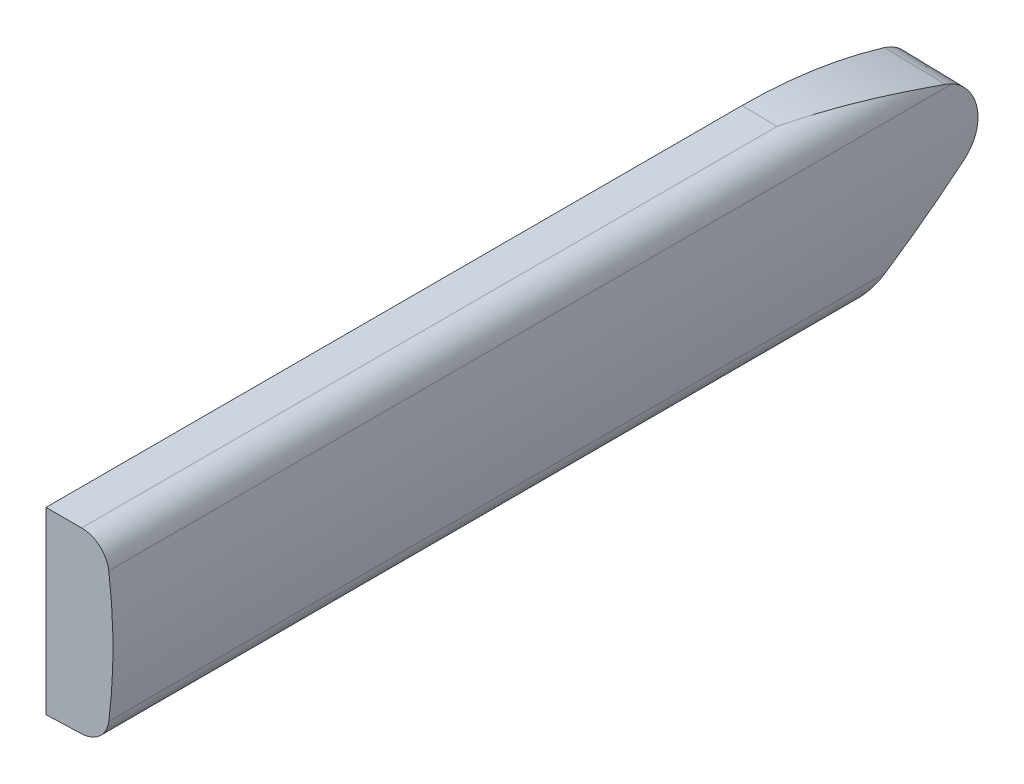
ISO-10303-21;
HEADER;
FILE_DESCRIPTION(('STEP AP214'),'2;1');
FILE_NAME('part.step','',(''),(''),'','','');
FILE_SCHEMA(('AUTOMOTIVE_DESIGN { 1 0 10303 214 1 1 1 1 }'));
ENDSEC;
DATA;
#1=APPLICATION_CONTEXT('core data for automotive mechanical design processes');
#2=APPLICATION_PROTOCOL_DEFINITION('international standard','automotive_design',2000,#1);
#3=PRODUCT_CONTEXT('',#1,'mechanical');
#4=PRODUCT('Part','Part','',(#3));
#5=PRODUCT_RELATED_PRODUCT_CATEGORY('part','',(#4));
#6=PRODUCT_DEFINITION_FORMATION('','',#4);
#7=PRODUCT_DEFINITION_CONTEXT('part definition',#1,'design');
#8=PRODUCT_DEFINITION('design','',#6,#7);
#9=PRODUCT_DEFINITION_SHAPE('','',#8);
#10=(LENGTH_UNIT() NAMED_UNIT(*) SI_UNIT(.MILLI.,.METRE.));
#11=(NAMED_UNIT(*) PLANE_ANGLE_UNIT() SI_UNIT($,.RADIAN.));
#12=(NAMED_UNIT(*) SI_UNIT($,.STERADIAN.) SOLID_ANGLE_UNIT());
#13=UNCERTAINTY_MEASURE_WITH_UNIT(LENGTH_MEASURE(1.E-05),#10,'distance_accuracy_value','');
#14=(GEOMETRIC_REPRESENTATION_CONTEXT(3) GLOBAL_UNCERTAINTY_ASSIGNED_CONTEXT((#13)) GLOBAL_UNIT_ASSIGNED_CONTEXT((#10,
#11,#12)) REPRESENTATION_CONTEXT('',''));
#15=CARTESIAN_POINT('',(0.,0.,0.));
#16=DIRECTION('',(0.,0.,1.));
#17=DIRECTION('',(1.,0.,0.));
#18=AXIS2_PLACEMENT_3D('',#15,#16,#17);
#19=CARTESIAN_POINT('',(0.,32.722620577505,-2.));
#20=DIRECTION('',(0.0174524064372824,0.999847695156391,0.));
#21=DIRECTION('',(-0.999847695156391,0.0174524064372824,0.));
#22=AXIS2_PLACEMENT_3D('',#19,#20,#21);
#23=PLANE('',#22);
#24=DIRECTION('',(0.,0.,1.));
#25=VECTOR('',#24,1.);
#26=CARTESIAN_POINT('',(12.7539243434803,32.5,-2.));
#27=LINE('',#26,#25);
#28=CARTESIAN_POINT('',(12.7539243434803,32.5,62.500000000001));
#29=VERTEX_POINT('',#28);
#30=CARTESIAN_POINT('',(12.7539243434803,32.5,316.000000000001));
#31=VERTEX_POINT('',#30);
#32=EDGE_CURVE('E314',#29,#31,#27,.T.);
#33=ORIENTED_EDGE('',*,*,#32,.F.);
#34=DIRECTION('',(0.999847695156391,-0.0174524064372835,0.));
#35=VECTOR('',#34,1.);
#36=CARTESIAN_POINT('',(0.,32.722620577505,62.500000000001));
#37=LINE('',#36,#35);
#38=CARTESIAN_POINT('',(0.,32.722620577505,62.500000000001));
#39=VERTEX_POINT('',#38);
#40=EDGE_CURVE('E246',#29,#39,#37,.F.);
#41=ORIENTED_EDGE('',*,*,#40,.T.);
#42=DIRECTION('',(0.,0.,1.));
#43=VECTOR('',#42,1.);
#44=CARTESIAN_POINT('',(0.,32.722620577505,-2.));
#45=LINE('',#44,#43);
#46=CARTESIAN_POINT('',(0.,32.722620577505,316.222620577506));
#47=VERTEX_POINT('',#46);
#48=EDGE_CURVE('E338',#39,#47,#45,.T.);
#49=ORIENTED_EDGE('',*,*,#48,.T.);
#50=DIRECTION('',(-0.999695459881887,0.0174497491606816,0.0174497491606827));
#51=VECTOR('',#50,1.);
#52=CARTESIAN_POINT('',(5.55121382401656,32.6257237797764,316.125723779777));
#53=LINE('',#52,#51);
#54=EDGE_CURVE('E317',#31,#47,#53,.T.);
#55=ORIENTED_EDGE('',*,*,#54,.F.);
#56=EDGE_LOOP('',(#33,#41,#49,#55));
#57=FACE_BOUND('',#56,.T.);
#58=ADVANCED_FACE('F34',(#57),#23,.T.);
#59=CARTESIAN_POINT('',(12.5794002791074,22.5015230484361,-2.));
#60=DIRECTION('',(0.,0.,1.));
#61=DIRECTION('',(1.,0.,0.));
#62=AXIS2_PLACEMENT_3D('',#59,#60,#61);
#63=CYLINDRICAL_SURFACE('',#62,10.);
#64=DIRECTION('',(0.,0.,1.));
#65=VECTOR('',#64,1.);
#66=CARTESIAN_POINT('',(22.5,23.7591800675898,-2.));
#67=LINE('',#66,#65);
#68=CARTESIAN_POINT('',(22.5,23.7591800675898,8.35774641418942));
#69=VERTEX_POINT('',#68);
#70=CARTESIAN_POINT('',(22.5,23.7591800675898,315.829881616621));
#71=VERTEX_POINT('',#70);
#72=EDGE_CURVE('E318',#69,#71,#67,.T.);
#73=ORIENTED_EDGE('',*,*,#72,.F.);
#74=CARTESIAN_POINT('',(22.5000253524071,23.7589800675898,8.35734817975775));
#75=CARTESIAN_POINT('',(22.4878789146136,23.8547589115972,8.54804917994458));
#76=CARTESIAN_POINT('',(22.4748592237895,23.9464079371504,8.74076411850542));
#77=CARTESIAN_POINT('',(22.4477677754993,24.1211388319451,9.1295374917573));
#78=CARTESIAN_POINT('',(22.4336980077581,24.2042362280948,9.32558908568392));
#79=CARTESIAN_POINT('',(22.405151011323,24.361911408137,9.72105857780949));
#80=CARTESIAN_POINT('',(22.3906737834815,24.4364892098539,9.92047646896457));
#81=CARTESIAN_POINT('',(22.3618844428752,24.5771254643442,10.3227220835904));
#82=CARTESIAN_POINT('',(22.3475726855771,24.6431678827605,10.5255554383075));
#83=CARTESIAN_POINT('',(22.3336584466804,24.7048041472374,10.7297478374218));
#84=B_SPLINE_CURVE_WITH_KNOTS('',3,(#74,#75,#76,#77,#78,#79,#80,#81,#82,#83),.UNSPECIFIED.,.F.,
.F.,(4,2,2,2,4),(0.,0.641185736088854,1.28118595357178,1.92118483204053,2.56236904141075),.UNSPECIFIED.);
#85=CARTESIAN_POINT('',(22.3342442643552,24.7022090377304,10.721160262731));
#86=VERTEX_POINT('',#85);
#87=EDGE_CURVE('E344',#69,#86,#84,.T.);
#88=ORIENTED_EDGE('',*,*,#87,.T.);
#89=CARTESIAN_POINT('',(18.2962657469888,14.2968018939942,-16.0791997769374));
#90=CARTESIAN_POINT('',(18.3765804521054,14.3527674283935,-15.961003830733));
#91=CARTESIAN_POINT('',(18.4549792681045,14.4091414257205,-15.8417174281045));
#92=CARTESIAN_POINT('',(18.6081351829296,14.5225851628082,-15.6011751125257));
#93=CARTESIAN_POINT('',(18.682892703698,14.579654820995,-15.4799194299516));
#94=CARTESIAN_POINT('',(18.9019175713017,14.7516682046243,-15.113637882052));
#95=CARTESIAN_POINT('',(19.0410444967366,14.8674917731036,-14.8659383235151));
#96=CARTESIAN_POINT('',(19.3065333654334,15.100390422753,-14.365450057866));
#97=CARTESIAN_POINT('',(19.4329298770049,15.2174611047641,-14.1126774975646));
#98=CARTESIAN_POINT('',(19.674583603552,15.4526366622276,-13.6022843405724));
#99=CARTESIAN_POINT('',(19.789838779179,15.5707417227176,-13.3446628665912));
#100=CARTESIAN_POINT('',(20.0089886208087,15.8062404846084,-12.8281886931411));
#101=CARTESIAN_POINT('',(20.1129926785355,15.9236280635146,-12.5693794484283));
#102=CARTESIAN_POINT('',(20.3118884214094,16.1586291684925,-12.0483738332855));
#103=CARTESIAN_POINT('',(20.4067793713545,16.2762427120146,-11.7861771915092));
#104=CARTESIAN_POINT('',(20.6790440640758,16.6291912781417,-10.9948001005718));
#105=CARTESIAN_POINT('',(20.8438423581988,16.8644509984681,-10.461233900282));
#106=CARTESIAN_POINT('',(21.1603189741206,17.357377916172,-9.32956205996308));
#107=CARTESIAN_POINT('',(21.3088630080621,17.614837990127,-8.73050300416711));
#108=CARTESIAN_POINT('',(21.5759852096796,18.1260682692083,-7.52408916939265));
#109=CARTESIAN_POINT('',(21.6945564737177,18.3798376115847,-6.91673251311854));
#110=CARTESIAN_POINT('',(21.905647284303,18.8827532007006,-5.69532042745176));
#111=CARTESIAN_POINT('',(21.9981544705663,19.1318972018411,-5.08126196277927));
#112=CARTESIAN_POINT('',(22.1601776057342,19.6247257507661,-3.84803180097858));
#113=CARTESIAN_POINT('',(22.2296952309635,19.868410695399,-3.22886048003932));
#114=CARTESIAN_POINT('',(22.3489190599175,20.3522886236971,-1.97997822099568));
#115=CARTESIAN_POINT('',(22.3984167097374,20.592420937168,-1.35022412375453));
#116=CARTESIAN_POINT('',(22.4787808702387,21.0662539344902,-0.0871324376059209));
#117=CARTESIAN_POINT('',(22.5096472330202,21.2999545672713,0.546205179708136));
#118=CARTESIAN_POINT('',(22.5545956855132,21.7605765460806,1.81569204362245));
#119=CARTESIAN_POINT('',(22.5686830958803,21.9875000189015,2.45184033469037));
#120=CARTESIAN_POINT('',(22.5816738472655,22.4344494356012,3.72671532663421));
#121=CARTESIAN_POINT('',(22.580576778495,22.6544751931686,4.36544209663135));
#122=CARTESIAN_POINT('',(22.5631621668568,23.1255476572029,5.75761692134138));
#123=CARTESIAN_POINT('',(22.5442021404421,23.3752458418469,6.51148805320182));
#124=CARTESIAN_POINT('',(22.489108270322,23.8647307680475,8.02184226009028));
#125=CARTESIAN_POINT('',(22.4529735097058,24.1045169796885,8.77832547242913));
#126=CARTESIAN_POINT('',(22.3651821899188,24.5740910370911,10.2936335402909));
#127=CARTESIAN_POINT('',(22.3135228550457,24.8038770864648,11.0524587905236));
#128=CARTESIAN_POINT('',(22.1961288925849,25.2533314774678,12.5720238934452));
#129=CARTESIAN_POINT('',(22.1303937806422,25.4729994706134,13.3327638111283));
#130=CARTESIAN_POINT('',(21.9138981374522,26.1171438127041,15.6188847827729));
#131=CARTESIAN_POINT('',(21.7439311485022,26.5263374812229,17.1468016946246));
#132=CARTESIAN_POINT('',(21.3615580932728,27.3037333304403,20.207475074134));
#133=CARTESIAN_POINT('',(21.1491554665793,27.6719388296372,21.7402311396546));
#134=CARTESIAN_POINT('',(20.6895031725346,28.3666106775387,24.8059412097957));
#135=CARTESIAN_POINT('',(20.4423393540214,28.6931761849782,26.3388857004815));
#136=CARTESIAN_POINT('',(19.9186759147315,29.3057410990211,29.4078641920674));
#137=CARTESIAN_POINT('',(19.6421755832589,29.5917395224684,30.9438982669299));
#138=CARTESIAN_POINT('',(19.0650796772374,30.1231852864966,34.0175324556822));
#139=CARTESIAN_POINT('',(18.7644974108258,30.3686547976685,35.5551312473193));
#140=CARTESIAN_POINT('',(18.1435815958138,30.8193984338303,38.6321442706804));
#141=CARTESIAN_POINT('',(17.8232487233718,31.0246739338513,40.1715584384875));
#142=CARTESIAN_POINT('',(17.127676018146,31.4173034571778,43.4355795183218));
#143=CARTESIAN_POINT('',(16.75044448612,31.5995992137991,45.1603738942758));
#144=CARTESIAN_POINT('',(15.981405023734,31.9142256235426,48.6111329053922));
#145=CARTESIAN_POINT('',(15.5895972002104,32.0465566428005,50.3370975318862));
#146=CARTESIAN_POINT('',(14.4000268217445,32.3686380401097,55.5136872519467));
#147=CARTESIAN_POINT('',(13.5874433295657,32.4838468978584,58.9660911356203));
#148=CARTESIAN_POINT('',(12.7668993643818,32.4997672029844,62.4449905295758));
#149=CARTESIAN_POINT('',(12.7604118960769,32.4998867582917,62.4724952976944));
#150=CARTESIAN_POINT('',(12.7539243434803,32.5,62.500000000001));
#151=B_SPLINE_CURVE_WITH_KNOTS('',3,(#89,#90,#91,#92,#93,#94,#95,#96,#97,#98,#99,#100,#101,#102,
#103,#104,#105,#106,#107,#108,#109,#110,#111,#112,#113,#114,#115,#116,#117,#118,#119,#120,#121,
#122,#123,#124,#125,#126,#127,#128,#129,#130,#131,#132,#133,#134,#135,#136,#137,#138,#139,#140,
#141,#142,#143,#144,#145,#146,#147,#148,#149,#150),.UNSPECIFIED.,.F.,.F.,(4,2,2,2,2,2,2,2,2,2,2,
2,2,2,2,2,2,2,2,2,2,2,2,2,2,2,2,2,2,2,4),(0.,0.460368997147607,0.92068452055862,1.8406975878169,
2.75814098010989,3.6757519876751,4.58343814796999,5.49119747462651,7.3081294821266,
9.3135371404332,11.3194062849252,13.3262250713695,15.3328974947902,17.3599665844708,
19.3870517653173,21.4134939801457,23.4399908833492,25.8228319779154,28.2058002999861,
30.5891949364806,32.9726716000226,37.7439170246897,42.5147758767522,47.2740526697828,
52.0334447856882,56.7902246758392,61.5468418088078,66.8708275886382,72.1947743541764,
82.8331483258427,82.9179275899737),.UNSPECIFIED.);
#152=EDGE_CURVE('E264',#86,#29,#151,.T.);
#153=ORIENTED_EDGE('',*,*,#152,.T.);
#154=ORIENTED_EDGE('',*,*,#32,.T.);
#155=CARTESIAN_POINT('',(12.5794002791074,22.5015230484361,316.003046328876));
#156=DIRECTION('',(-0.0174524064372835,0.,-0.999847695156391));
#157=DIRECTION('',(-0.999847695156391,0.,0.0174524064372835));
#158=AXIS2_PLACEMENT_3D('',#155,#156,#157);
#159=ELLIPSE('',#158,10.0015232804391,10.);
#160=EDGE_CURVE('E261',#31,#71,#159,.T.);
#161=ORIENTED_EDGE('',*,*,#160,.T.);
#162=EDGE_LOOP('',(#73,#88,#153,#154,#161));
#163=FACE_BOUND('',#162,.T.);
#164=ADVANCED_FACE('F279',(#163),#63,.T.);
#165=CARTESIAN_POINT('',(-164.916212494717,0.,-2.));
#166=DIRECTION('',(0.,0.,1.));
#167=DIRECTION('',(1.,0.,0.));
#168=AXIS2_PLACEMENT_3D('',#165,#166,#167);
#169=CYLINDRICAL_SURFACE('',#168,188.916212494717);
#170=DIRECTION('',(0.,0.,1.));
#171=VECTOR('',#170,1.);
#172=CARTESIAN_POINT('',(22.5,-23.7591800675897,-2.));
#173=LINE('',#172,#171);
#174=CARTESIAN_POINT('',(22.5,-23.7591800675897,32.7573007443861));
#175=VERTEX_POINT('',#174);
#176=CARTESIAN_POINT('',(22.5,-23.7591800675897,315.829881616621));
#177=VERTEX_POINT('',#176);
#178=EDGE_CURVE('E322',#175,#177,#173,.T.);
#179=ORIENTED_EDGE('',*,*,#178,.F.);
#180=CARTESIAN_POINT('',(-164.916212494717,0.,-0.647123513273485));
#181=DIRECTION('',(-0.0174524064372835,0.76592777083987,0.642689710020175));
#182=DIRECTION('',(0.0146405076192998,-0.642522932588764,0.766126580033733));
#183=AXIS2_PLACEMENT_3D('',#180,#181,#182);
#184=ELLIPSE('',#183,293.946222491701,188.916212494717);
#185=CARTESIAN_POINT('',(23.9981310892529,-0.840316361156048,5.48434472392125));
#186=VERTEX_POINT('',#185);
#187=EDGE_CURVE('E349',#175,#186,#184,.T.);
#188=ORIENTED_EDGE('',*,*,#187,.T.);
#189=CARTESIAN_POINT('',(23.9964299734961,-1.16140390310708,5.88062454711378));
#190=CARTESIAN_POINT('',(23.9980069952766,-0.905037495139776,5.55276781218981));
#191=CARTESIAN_POINT('',(23.9991459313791,-0.634785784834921,5.23577643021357));
#192=CARTESIAN_POINT('',(24.0001993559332,-0.0685940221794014,4.62565360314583));
#193=CARTESIAN_POINT('',(24.0001138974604,0.227344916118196,4.33252112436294));
#194=CARTESIAN_POINT('',(23.9983710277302,0.842648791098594,3.77240103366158));
#195=CARTESIAN_POINT('',(23.9967146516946,1.16199817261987,3.5053963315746));
#196=CARTESIAN_POINT('',(23.9915017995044,1.82200497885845,2.99919867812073));
#197=CARTESIAN_POINT('',(23.9879453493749,2.16266211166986,2.76000534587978));
#198=CARTESIAN_POINT('',(23.9786287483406,2.86303805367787,2.31100926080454));
#199=CARTESIAN_POINT('',(23.9728674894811,3.22276636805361,2.1012213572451));
#200=CARTESIAN_POINT('',(23.9588799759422,3.9585554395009,1.71266211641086));
#201=CARTESIAN_POINT('',(23.9506537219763,4.33461619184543,1.53389077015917));
#202=CARTESIAN_POINT('',(23.9315277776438,5.10028805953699,1.20866327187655));
#203=CARTESIAN_POINT('',(23.920628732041,5.48989588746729,1.06219934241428));
#204=CARTESIAN_POINT('',(23.8960054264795,6.27995959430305,0.802556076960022));
#205=CARTESIAN_POINT('',(23.8822811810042,6.68041541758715,0.68937657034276));
#206=CARTESIAN_POINT('',(23.8519318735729,7.4891014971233,0.49713252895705));
#207=CARTESIAN_POINT('',(23.8353083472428,7.89732753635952,0.418050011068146));
#208=CARTESIAN_POINT('',(23.7991446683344,8.71885080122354,0.294444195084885));
#209=CARTESIAN_POINT('',(23.7796045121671,9.13214803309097,0.249920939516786));
#210=CARTESIAN_POINT('',(23.7376682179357,9.96096602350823,0.195708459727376));
#211=CARTESIAN_POINT('',(23.7152714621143,10.3764872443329,0.186026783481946));
#212=CARTESIAN_POINT('',(23.6677677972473,11.2067216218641,0.201548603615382));
#213=CARTESIAN_POINT('',(23.6426608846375,11.6214347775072,0.226752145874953));
#214=CARTESIAN_POINT('',(23.5899094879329,12.4478536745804,0.311902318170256));
#215=CARTESIAN_POINT('',(23.5622606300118,12.8595528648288,0.371909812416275));
#216=CARTESIAN_POINT('',(23.5047565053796,13.6763077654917,0.526254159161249));
#217=CARTESIAN_POINT('',(23.4749012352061,14.0813634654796,0.620591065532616));
#218=CARTESIAN_POINT('',(23.4133513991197,14.8819309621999,0.84288081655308));
#219=CARTESIAN_POINT('',(23.3816571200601,15.2774442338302,0.970828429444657));
#220=CARTESIAN_POINT('',(23.3168489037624,16.0562335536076,1.25942436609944));
#221=CARTESIAN_POINT('',(23.2837349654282,16.4395095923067,1.42007271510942));
#222=CARTESIAN_POINT('',(23.2164106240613,17.1928810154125,1.77374027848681));
#223=CARTESIAN_POINT('',(23.1821958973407,17.5629080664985,1.96690424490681));
#224=CARTESIAN_POINT('',(23.1133425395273,18.2853345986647,2.38372301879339));
#225=CARTESIAN_POINT('',(23.0787039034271,18.6377338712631,2.60737818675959));
#226=CARTESIAN_POINT('',(23.0095596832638,19.3224725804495,3.083642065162));
#227=CARTESIAN_POINT('',(22.9750541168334,19.6548094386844,3.33625448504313));
#228=CARTESIAN_POINT('',(22.9067628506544,20.2970336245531,3.86864998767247));
#229=CARTESIAN_POINT('',(22.8729771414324,20.6069212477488,4.14843271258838));
#230=CARTESIAN_POINT('',(22.8076543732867,21.1936270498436,4.72494232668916));
#231=CARTESIAN_POINT('',(22.776080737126,21.4711328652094,5.02096571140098));
#232=CARTESIAN_POINT('',(22.7147074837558,22.0010076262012,5.63487870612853));
#233=CARTESIAN_POINT('',(22.6849078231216,22.2533771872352,5.95276778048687));
#234=CARTESIAN_POINT('',(22.6275892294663,22.7313851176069,6.6085053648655));
#235=CARTESIAN_POINT('',(22.6000715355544,22.9570089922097,6.94636455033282));
#236=CARTESIAN_POINT('',(22.5478160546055,23.3798721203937,7.63965184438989));
#237=CARTESIAN_POINT('',(22.5230785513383,23.5771084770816,7.99508174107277));
#238=CARTESIAN_POINT('',(22.4999746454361,23.7593800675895,8.35814467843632));
#239=B_SPLINE_CURVE_WITH_KNOTS('',3,(#189,#190,#191,#192,#193,#194,#195,#196,#197,#198,#199,
#200,#201,#202,#203,#204,#205,#206,#207,#208,#209,#210,#211,#212,#213,#214,#215,#216,#217,#218,
#219,#220,#221,#222,#223,#224,#225,#226,#227,#228,#229,#230,#231,#232,#233,#234,#235,#236,#237,
#238),.UNSPECIFIED.,.F.,.F.,(4,2,2,2,2,2,2,2,2,2,2,2,2,2,2,2,2,2,2,2,2,2,2,2,4),(0.,
1.24819785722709,2.49634160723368,3.74366341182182,4.99096813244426,6.23890047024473,
7.48683244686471,8.73446367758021,9.9820885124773,11.2290545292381,12.4760220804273,
13.7232597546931,14.9704990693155,16.2199261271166,17.4693551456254,18.7185897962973,
19.9678254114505,21.2227769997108,22.4777434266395,23.7328707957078,24.9879816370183,
26.2075763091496,27.4271411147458,28.6473638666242,29.8677110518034),.UNSPECIFIED.);
#240=EDGE_CURVE('E272',#186,#69,#239,.T.);
#241=ORIENTED_EDGE('',*,*,#240,.T.);
#242=ORIENTED_EDGE('',*,*,#72,.T.);
#243=CARTESIAN_POINT('',(-164.916212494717,0.,319.101243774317));
#244=DIRECTION('',(-0.0174524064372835,0.,-0.999847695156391));
#245=DIRECTION('',(-0.999847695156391,0.,0.0174524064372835));
#246=AXIS2_PLACEMENT_3D('',#243,#244,#245);
#247=ELLIPSE('',#246,188.944989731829,188.916212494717);
#248=EDGE_CURVE('E259',#71,#177,#247,.T.);
#249=ORIENTED_EDGE('',*,*,#248,.T.);
#250=EDGE_LOOP('',(#179,#188,#241,#242,#249));
#251=FACE_BOUND('',#250,.T.);
#252=ADVANCED_FACE('F310',(#251),#169,.T.);
#253=CARTESIAN_POINT('',(12.5794002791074,-22.5015230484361,-2.));
#254=DIRECTION('',(0.,0.,1.));
#255=DIRECTION('',(1.,0.,0.));
#256=AXIS2_PLACEMENT_3D('',#253,#254,#255);
#257=CYLINDRICAL_SURFACE('',#256,10.);
#258=DIRECTION('',(0.,0.,1.));
#259=VECTOR('',#258,1.);
#260=CARTESIAN_POINT('',(12.7539243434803,-32.5,-2.));
#261=LINE('',#260,#259);
#262=CARTESIAN_POINT('',(12.7539243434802,-32.5,44.7293982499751));
#263=VERTEX_POINT('',#262);
#264=CARTESIAN_POINT('',(12.75392434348,-32.5,316.000000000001));
#265=VERTEX_POINT('',#264);
#266=EDGE_CURVE('E334',#263,#265,#261,.T.);
#267=ORIENTED_EDGE('',*,*,#266,.F.);
#268=CARTESIAN_POINT('',(12.7539243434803,-32.5,44.7293982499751));
#269=CARTESIAN_POINT('',(12.759366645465,-32.4999050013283,44.7255490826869));
#270=CARTESIAN_POINT('',(12.7648089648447,-32.4998055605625,44.7216999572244));
#271=CARTESIAN_POINT('',(13.1078588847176,-32.4932574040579,44.4790787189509));
#272=CARTESIAN_POINT('',(13.4455183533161,-32.4697165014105,44.2404932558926));
#273=CARTESIAN_POINT('',(14.1193866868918,-32.3880686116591,43.7666693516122));
#274=CARTESIAN_POINT('',(14.4555939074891,-32.3299294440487,43.5314342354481));
#275=CARTESIAN_POINT('',(15.1247203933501,-32.1782497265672,43.0676631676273));
#276=CARTESIAN_POINT('',(15.4576394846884,-32.0847073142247,42.8391275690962));
#277=CARTESIAN_POINT('',(16.1179467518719,-31.86101181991,42.3927230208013));
#278=CARTESIAN_POINT('',(16.4453405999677,-31.7308990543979,42.1748426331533));
#279=CARTESIAN_POINT('',(16.9002057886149,-31.5210347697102,41.879179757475));
#280=CARTESIAN_POINT('',(17.0310048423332,-31.4572274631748,41.7949985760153));
#281=CARTESIAN_POINT('',(17.290916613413,-31.3232542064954,41.6296641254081));
#282=CARTESIAN_POINT('',(17.4200316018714,-31.2530981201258,41.5485064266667));
#283=CARTESIAN_POINT('',(17.5483202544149,-31.1796469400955,41.4689785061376));
#284=B_SPLINE_CURVE_WITH_KNOTS('',3,(#268,#269,#270,#271,#272,#273,#274,#275,#276,#277,#278,
#279,#280,#281,#282,#283),.UNSPECIFIED.,.F.,.F.,(4,2,2,2,2,2,2,4),(0.,0.0200000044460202,
1.2606726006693,2.50250097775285,3.74439469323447,4.98492463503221,5.48917146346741,
5.99264789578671),.UNSPECIFIED.);
#285=CARTESIAN_POINT('',(17.3903144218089,-31.2682273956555,41.5674800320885));
#286=VERTEX_POINT('',#285);
#287=EDGE_CURVE('E325',#263,#286,#284,.T.);
#288=ORIENTED_EDGE('',*,*,#287,.T.);
#289=CARTESIAN_POINT('',(12.5794002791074,-22.5015230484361,30.9890870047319));
#290=DIRECTION('',(-0.0174524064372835,0.76592777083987,0.642689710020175));
#291=DIRECTION('',(0.0146405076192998,-0.642522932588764,0.766126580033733));
#292=AXIS2_PLACEMENT_3D('',#289,#290,#291);
#293=ELLIPSE('',#292,15.5596080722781,10.);
#294=EDGE_CURVE('E347',#286,#175,#293,.T.);
#295=ORIENTED_EDGE('',*,*,#294,.T.);
#296=ORIENTED_EDGE('',*,*,#178,.T.);
#297=CARTESIAN_POINT('',(12.5794002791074,-22.5015230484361,316.003046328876));
#298=DIRECTION('',(-0.0174524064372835,0.,-0.999847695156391));
#299=DIRECTION('',(-0.999847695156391,0.,0.0174524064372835));
#300=AXIS2_PLACEMENT_3D('',#297,#298,#299);
#301=ELLIPSE('',#300,10.0015232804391,10.);
#302=EDGE_CURVE('E249',#177,#265,#301,.T.);
#303=ORIENTED_EDGE('',*,*,#302,.T.);
#304=EDGE_LOOP('',(#267,#288,#295,#296,#303));
#305=FACE_BOUND('',#304,.T.);
#306=ADVANCED_FACE('F360',(#305),#257,.T.);
#307=CARTESIAN_POINT('',(0.,32.722620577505,-2.));
#308=DIRECTION('',(-1.,0.,0.));
#309=DIRECTION('',(0.,0.,1.));
#310=AXIS2_PLACEMENT_3D('',#307,#308,#309);
#311=PLANE('',#310);
#312=DIRECTION('',(0.,0.642787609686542,-0.766044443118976));
#313=VECTOR('',#312,1.);
#314=CARTESIAN_POINT('',(0.,17.9238357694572,-14.4176548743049));
#315=LINE('',#314,#313);
#316=CARTESIAN_POINT('',(0.,0.371118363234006,6.5008591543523));
#317=VERTEX_POINT('',#316);
#318=CARTESIAN_POINT('',(0.,-29.9684372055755,42.6581335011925));
#319=VERTEX_POINT('',#318);
#320=EDGE_CURVE('E225',#317,#319,#315,.F.);
#321=ORIENTED_EDGE('',*,*,#320,.F.);
#322=CARTESIAN_POINT('',(0.,10.5,15.000000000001));
#323=DIRECTION('',(-1.,0.,0.));
#324=DIRECTION('',(0.,0.,1.));
#325=AXIS2_PLACEMENT_3D('',#322,#323,#324);
#326=CIRCLE('',#325,13.2223159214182);
#327=CARTESIAN_POINT('',(0.,23.1602133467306,11.185732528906));
#328=VERTEX_POINT('',#327);
#329=EDGE_CURVE('E221',#328,#317,#326,.T.);
#330=ORIENTED_EDGE('',*,*,#329,.F.);
#331=CARTESIAN_POINT('',(0.,-147.160714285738,62.500000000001));
#332=DIRECTION('',(-1.,0.,0.));
#333=DIRECTION('',(0.,0.,1.));
#334=AXIS2_PLACEMENT_3D('',#331,#332,#333);
#335=CIRCLE('',#334,177.883030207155);
#336=CARTESIAN_POINT('',(0.,30.7223159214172,62.500000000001));
#337=VERTEX_POINT('',#336);
#338=EDGE_CURVE('E48',#337,#328,#335,.T.);
#339=ORIENTED_EDGE('',*,*,#338,.F.);
#340=DIRECTION('',(0.,0.,1.));
#341=VECTOR('',#340,1.);
#342=CARTESIAN_POINT('',(0.,30.7223159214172,-2.));
#343=LINE('',#342,#341);
#344=CARTESIAN_POINT('',(0.,30.7223159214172,314.222315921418));
#345=VERTEX_POINT('',#344);
#346=EDGE_CURVE('E167',#337,#345,#343,.T.);
#347=ORIENTED_EDGE('',*,*,#346,.T.);
#348=DIRECTION('',(0.,1.,0.));
#349=VECTOR('',#348,1.);
#350=CARTESIAN_POINT('',(0.,-32.722620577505,314.222315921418));
#351=LINE('',#350,#349);
#352=CARTESIAN_POINT('',(0.,-30.7223159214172,314.222315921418));
#353=VERTEX_POINT('',#352);
#354=EDGE_CURVE('E188',#345,#353,#351,.F.);
#355=ORIENTED_EDGE('',*,*,#354,.T.);
#356=DIRECTION('',(0.,0.,1.));
#357=VECTOR('',#356,1.);
#358=CARTESIAN_POINT('',(0.,-30.7223159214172,-2.));
#359=LINE('',#358,#357);
#360=CARTESIAN_POINT('',(0.,-30.7223159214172,44.7293982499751));
#361=VERTEX_POINT('',#360);
#362=EDGE_CURVE('E218',#361,#353,#359,.T.);
#363=ORIENTED_EDGE('',*,*,#362,.F.);
#364=CARTESIAN_POINT('',(0.,-27.5,44.7293982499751));
#365=DIRECTION('',(-1.,0.,0.));
#366=DIRECTION('',(0.,0.,1.));
#367=AXIS2_PLACEMENT_3D('',#364,#365,#366);
#368=CIRCLE('',#367,3.22231592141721);
#369=EDGE_CURVE('E222',#319,#361,#368,.T.);
#370=ORIENTED_EDGE('',*,*,#369,.F.);
#371=EDGE_LOOP('',(#321,#330,#339,#347,#355,#363,#370));
#372=FACE_BOUND('',#371,.T.);
#373=DIRECTION('',(0.,-0.642787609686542,0.766044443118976));
#374=VECTOR('',#373,1.);
#375=CARTESIAN_POINT('',(0.,-1.16120390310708,5.21508810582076));
#376=LINE('',#375,#374);
#377=CARTESIAN_POINT('',(0.,-1.16120390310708,5.21508810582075));
#378=VERTEX_POINT('',#377);
#379=CARTESIAN_POINT('',(0.,-31.5007594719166,41.3723624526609));
#380=VERTEX_POINT('',#379);
#381=EDGE_CURVE('E241',#378,#380,#376,.T.);
#382=ORIENTED_EDGE('',*,*,#381,.T.);
#383=CARTESIAN_POINT('',(0.,-27.5,44.7293982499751));
#384=DIRECTION('',(-1.,0.,0.));
#385=DIRECTION('',(0.,0.,1.));
#386=AXIS2_PLACEMENT_3D('',#383,#384,#385);
#387=CIRCLE('',#386,5.22262057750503);
#388=CARTESIAN_POINT('',(0.,-32.722620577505,44.7293982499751));
#389=VERTEX_POINT('',#388);
#390=EDGE_CURVE('E214',#380,#389,#387,.T.);
#391=ORIENTED_EDGE('',*,*,#390,.T.);
#392=DIRECTION('',(0.,0.,1.));
#393=VECTOR('',#392,1.);
#394=CARTESIAN_POINT('',(0.,-32.722620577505,-2.));
#395=LINE('',#394,#393);
#396=CARTESIAN_POINT('',(0.,-32.722620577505,316.222620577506));
#397=VERTEX_POINT('',#396);
#398=EDGE_CURVE('E56',#389,#397,#395,.T.);
#399=ORIENTED_EDGE('',*,*,#398,.T.);
#400=DIRECTION('',(0.,-1.,0.));
#401=VECTOR('',#400,1.);
#402=CARTESIAN_POINT('',(0.,32.722620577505,316.222620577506));
#403=LINE('',#402,#401);
#404=EDGE_CURVE('E41',#47,#397,#403,.T.);
#405=ORIENTED_EDGE('',*,*,#404,.F.);
#406=ORIENTED_EDGE('',*,*,#48,.F.);
#407=CARTESIAN_POINT('',(0.,-147.160714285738,62.500000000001));
#408=DIRECTION('',(-1.,0.,0.));
#409=DIRECTION('',(0.,0.,1.));
#410=AXIS2_PLACEMENT_3D('',#407,#408,#409);
#411=CIRCLE('',#410,179.883334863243);
#412=CARTESIAN_POINT('',(0.,25.0754817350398,10.608700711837));
#413=VERTEX_POINT('',#412);
#414=EDGE_CURVE('E235',#39,#413,#411,.T.);
#415=ORIENTED_EDGE('',*,*,#414,.T.);
#416=CARTESIAN_POINT('',(0.,10.5,15.000000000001));
#417=DIRECTION('',(-1.,0.,0.));
#418=DIRECTION('',(0.,0.,1.));
#419=AXIS2_PLACEMENT_3D('',#416,#417,#418);
#420=CIRCLE('',#419,15.222620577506);
#421=EDGE_CURVE('E238',#413,#378,#420,.T.);
#422=ORIENTED_EDGE('',*,*,#421,.T.);
#423=EDGE_LOOP('',(#382,#391,#399,#405,#406,#415,#422));
#424=FACE_BOUND('',#423,.T.);
#425=ADVANCED_FACE('F301',(#372,#424),#311,.T.);
#426=CARTESIAN_POINT('',(0.,-32.722620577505,-2.));
#427=DIRECTION('',(0.0174524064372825,-0.999847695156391,0.));
#428=DIRECTION('',(0.999847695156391,0.0174524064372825,0.));
#429=AXIS2_PLACEMENT_3D('',#426,#427,#428);
#430=PLANE('',#429);
#431=DIRECTION('',(0.999847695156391,0.0174524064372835,0.));
#432=VECTOR('',#431,1.);
#433=CARTESIAN_POINT('',(0.,-32.722620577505,44.7293982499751));
#434=LINE('',#433,#432);
#435=EDGE_CURVE('E244',#263,#389,#434,.F.);
#436=ORIENTED_EDGE('',*,*,#435,.F.);
#437=ORIENTED_EDGE('',*,*,#266,.T.);
#438=DIRECTION('',(-0.999695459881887,-0.0174497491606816,0.0174497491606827));
#439=VECTOR('',#438,1.);
#440=CARTESIAN_POINT('',(0.,-32.722620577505,316.222620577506));
#441=LINE('',#440,#439);
#442=EDGE_CURVE('E12',#265,#397,#441,.T.);
#443=ORIENTED_EDGE('',*,*,#442,.T.);
#444=ORIENTED_EDGE('',*,*,#398,.F.);
#445=EDGE_LOOP('',(#436,#437,#443,#444));
#446=FACE_BOUND('',#445,.T.);
#447=ADVANCED_FACE('F292',(#446),#430,.T.);
#448=CARTESIAN_POINT('',(0.,-32.722620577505,316.222620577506));
#449=DIRECTION('',(-0.0174524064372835,0.,-0.999847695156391));
#450=DIRECTION('',(-0.999847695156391,0.,0.0174524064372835));
#451=AXIS2_PLACEMENT_3D('',#448,#449,#450);
#452=PLANE('',#451);
#453=ORIENTED_EDGE('',*,*,#160,.F.);
#454=ORIENTED_EDGE('',*,*,#54,.T.);
#455=ORIENTED_EDGE('',*,*,#404,.T.);
#456=ORIENTED_EDGE('',*,*,#442,.F.);
#457=ORIENTED_EDGE('',*,*,#302,.F.);
#458=ORIENTED_EDGE('',*,*,#248,.F.);
#459=EDGE_LOOP('',(#453,#454,#455,#456,#457,#458));
#460=FACE_BOUND('',#459,.T.);
#461=ADVANCED_FACE('F289',(#460),#452,.F.);
#462=CARTESIAN_POINT('',(0.,-27.5,44.7293982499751));
#463=DIRECTION('',(-1.,0.,0.));
#464=DIRECTION('',(0.,0.,1.));
#465=AXIS2_PLACEMENT_3D('',#462,#463,#464);
#466=CONICAL_SURFACE('',#465,5.22262057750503,0.0174532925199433);
#467=ORIENTED_EDGE('',*,*,#435,.T.);
#468=ORIENTED_EDGE('',*,*,#390,.F.);
#469=DIRECTION('',(0.999847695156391,0.0133693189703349,0.0112181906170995));
#470=VECTOR('',#469,1.);
#471=CARTESIAN_POINT('',(0.,-31.5007594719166,41.3723624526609));
#472=LINE('',#471,#470);
#473=EDGE_CURVE('E247',#286,#380,#472,.F.);
#474=ORIENTED_EDGE('',*,*,#473,.F.);
#475=ORIENTED_EDGE('',*,*,#287,.F.);
#476=EDGE_LOOP('',(#467,#468,#474,#475));
#477=FACE_BOUND('',#476,.T.);
#478=ADVANCED_FACE('F291',(#477),#466,.T.);
#479=CARTESIAN_POINT('',(0.,-1.16120390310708,5.21508810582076));
#480=DIRECTION('',(-0.0174524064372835,0.76592777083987,0.642689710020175));
#481=DIRECTION('',(0.,-0.642787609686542,0.766044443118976));
#482=AXIS2_PLACEMENT_3D('',#479,#480,#481);
#483=PLANE('',#482);
#484=ORIENTED_EDGE('',*,*,#294,.F.);
#485=ORIENTED_EDGE('',*,*,#473,.T.);
#486=ORIENTED_EDGE('',*,*,#381,.F.);
#487=DIRECTION('',(0.999847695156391,0.0133693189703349,0.0112181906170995));
#488=VECTOR('',#487,1.);
#489=CARTESIAN_POINT('',(0.,-1.16120390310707,5.21508810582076));
#490=LINE('',#489,#488);
#491=EDGE_CURVE('E250',#186,#378,#490,.F.);
#492=ORIENTED_EDGE('',*,*,#491,.F.);
#493=ORIENTED_EDGE('',*,*,#187,.F.);
#494=EDGE_LOOP('',(#484,#485,#486,#492,#493));
#495=FACE_BOUND('',#494,.T.);
#496=ADVANCED_FACE('F298',(#495),#483,.F.);
#497=CARTESIAN_POINT('',(0.,10.5,15.000000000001));
#498=DIRECTION('',(-1.,0.,0.));
#499=DIRECTION('',(0.,0.,1.));
#500=AXIS2_PLACEMENT_3D('',#497,#498,#499);
#501=CONICAL_SURFACE('',#500,15.222620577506,0.0174532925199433);
#502=ORIENTED_EDGE('',*,*,#240,.F.);
#503=ORIENTED_EDGE('',*,*,#491,.T.);
#504=ORIENTED_EDGE('',*,*,#421,.F.);
#505=DIRECTION('',(0.999847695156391,-0.0167104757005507,0.00503452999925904));
#506=VECTOR('',#505,1.);
#507=CARTESIAN_POINT('',(0.,25.0754817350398,10.608700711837));
#508=LINE('',#507,#506);
#509=EDGE_CURVE('E252',#86,#413,#508,.F.);
#510=ORIENTED_EDGE('',*,*,#509,.F.);
#511=ORIENTED_EDGE('',*,*,#87,.F.);
#512=EDGE_LOOP('',(#502,#503,#504,#510,#511));
#513=FACE_BOUND('',#512,.T.);
#514=ADVANCED_FACE('F285',(#513),#501,.T.);
#515=CARTESIAN_POINT('',(0.,-147.160714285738,62.500000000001));
#516=DIRECTION('',(-1.,0.,0.));
#517=DIRECTION('',(0.,0.,1.));
#518=AXIS2_PLACEMENT_3D('',#515,#516,#517);
#519=CONICAL_SURFACE('',#518,179.883334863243,0.0174532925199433);
#520=ORIENTED_EDGE('',*,*,#509,.T.);
#521=ORIENTED_EDGE('',*,*,#414,.F.);
#522=ORIENTED_EDGE('',*,*,#40,.F.);
#523=ORIENTED_EDGE('',*,*,#152,.F.);
#524=EDGE_LOOP('',(#520,#521,#522,#523));
#525=FACE_BOUND('',#524,.T.);
#526=ADVANCED_FACE('F282',(#525),#519,.T.);
#527=CARTESIAN_POINT('',(-0.0349048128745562,30.7229251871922,-2.));
#528=DIRECTION('',(0.0174524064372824,0.999847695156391,0.));
#529=DIRECTION('',(-0.999847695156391,0.0174524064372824,0.));
#530=AXIS2_PLACEMENT_3D('',#527,#528,#529);
#531=PLANE('',#530);
#532=DIRECTION('',(0.,0.,1.));
#533=VECTOR('',#532,1.);
#534=CARTESIAN_POINT('',(12.7190195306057,30.5003046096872,-2.));
#535=LINE('',#534,#533);
#536=CARTESIAN_POINT('',(12.7190195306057,30.5003046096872,62.500000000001));
#537=VERTEX_POINT('',#536);
#538=CARTESIAN_POINT('',(12.7190195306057,30.5003046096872,314.000304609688));
#539=VERTEX_POINT('',#538);
#540=EDGE_CURVE('E165',#537,#539,#535,.T.);
#541=ORIENTED_EDGE('',*,*,#540,.T.);
#542=DIRECTION('',(0.999695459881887,-0.0174497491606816,-0.0174497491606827));
#543=VECTOR('',#542,1.);
#544=CARTESIAN_POINT('',(1.07186688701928,30.7036064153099,314.203606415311));
#545=LINE('',#544,#543);
#546=EDGE_CURVE('E185',#539,#345,#545,.F.);
#547=ORIENTED_EDGE('',*,*,#546,.T.);
#548=ORIENTED_EDGE('',*,*,#346,.F.);
#549=DIRECTION('',(-0.999847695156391,0.0174524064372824,0.));
#550=VECTOR('',#549,1.);
#551=CARTESIAN_POINT('',(-0.0349048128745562,30.7229251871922,62.500000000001));
#552=LINE('',#551,#550);
#553=EDGE_CURVE('E160',#537,#337,#552,.T.);
#554=ORIENTED_EDGE('',*,*,#553,.F.);
#555=EDGE_LOOP('',(#541,#547,#548,#554));
#556=FACE_BOUND('',#555,.T.);
#557=ADVANCED_FACE('F162',(#556),#531,.F.);
#558=CARTESIAN_POINT('',(12.5794002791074,22.5015230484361,-2.));
#559=DIRECTION('',(0.,0.,1.));
#560=DIRECTION('',(1.,0.,0.));
#561=AXIS2_PLACEMENT_3D('',#558,#559,#560);
#562=CYLINDRICAL_SURFACE('',#561,8.00000000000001);
#563=DIRECTION('',(0.,0.,1.));
#564=VECTOR('',#563,1.);
#565=CARTESIAN_POINT('',(20.5158800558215,23.5076486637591,-2.));
#566=LINE('',#565,#564);
#567=CARTESIAN_POINT('',(20.5158800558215,23.507648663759,13.6388846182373));
#568=VERTEX_POINT('',#567);
#569=CARTESIAN_POINT('',(20.5158800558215,23.5076486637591,313.864209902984));
#570=VERTEX_POINT('',#569);
#571=EDGE_CURVE('E186',#568,#570,#566,.T.);
#572=ORIENTED_EDGE('',*,*,#571,.T.);
#573=CARTESIAN_POINT('',(12.5794002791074,22.5015230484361,314.002741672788));
#574=DIRECTION('',(-0.0174524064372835,0.,-0.999847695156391));
#575=DIRECTION('',(-0.999847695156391,0.,0.0174524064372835));
#576=AXIS2_PLACEMENT_3D('',#573,#574,#575);
#577=ELLIPSE('',#576,8.00121862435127,8.00000000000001);
#578=EDGE_CURVE('E180',#539,#570,#577,.T.);
#579=ORIENTED_EDGE('',*,*,#578,.F.);
#580=ORIENTED_EDGE('',*,*,#540,.F.);
#581=CARTESIAN_POINT('',(20.5732022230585,22.8163729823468,11.2893247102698));
#582=CARTESIAN_POINT('',(20.5655564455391,23.0097010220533,11.9305457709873));
#583=CARTESIAN_POINT('',(20.5510892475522,23.1994816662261,12.5727285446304));
#584=CARTESIAN_POINT('',(20.5096965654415,23.5718587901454,13.8587268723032));
#585=CARTESIAN_POINT('',(20.4827719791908,23.7544557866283,14.5025423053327));
#586=CARTESIAN_POINT('',(20.4176616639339,24.1123270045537,15.7913300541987));
#587=CARTESIAN_POINT('',(20.3794807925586,24.2876043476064,16.4363017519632));
#588=CARTESIAN_POINT('',(20.2928423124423,24.6308750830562,17.7274962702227));
#589=CARTESIAN_POINT('',(20.244384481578,24.7988683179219,18.3737191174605));
#590=CARTESIAN_POINT('',(20.0850355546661,25.2916279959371,20.3130711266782));
#591=CARTESIAN_POINT('',(19.9601168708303,25.6054456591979,21.6078607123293));
#592=CARTESIAN_POINT('',(19.6788841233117,26.2037590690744,24.2009583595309));
#593=CARTESIAN_POINT('',(19.5225644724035,26.4882495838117,25.4992670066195));
#594=CARTESIAN_POINT('',(19.1604513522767,27.0645029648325,28.2750675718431));
#595=CARTESIAN_POINT('',(18.9508218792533,27.3520044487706,29.7529434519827));
#596=CARTESIAN_POINT('',(18.503514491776,27.8891957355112,32.7113955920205));
#597=CARTESIAN_POINT('',(18.265834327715,28.1388825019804,34.1919720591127));
#598=CARTESIAN_POINT('',(17.7675126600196,28.6006128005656,37.1555845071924));
#599=CARTESIAN_POINT('',(17.506864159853,28.8126448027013,38.6386211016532));
#600=CARTESIAN_POINT('',(16.9671856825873,29.1990957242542,41.6061821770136));
#601=CARTESIAN_POINT('',(16.688156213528,29.3735156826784,43.0907066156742));
#602=CARTESIAN_POINT('',(16.1156515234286,29.6849160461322,46.0613657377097));
#603=CARTESIAN_POINT('',(15.8221720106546,29.8218852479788,47.5475007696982));
#604=CARTESIAN_POINT('',(15.2245341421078,30.0584108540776,50.5206118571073));
#605=CARTESIAN_POINT('',(14.920375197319,30.1579651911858,52.0075879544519));
#606=CARTESIAN_POINT('',(13.9972891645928,30.4005315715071,56.4683407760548));
#607=CARTESIAN_POINT('',(13.3674911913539,30.487585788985,59.4432678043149));
#608=CARTESIAN_POINT('',(12.7306836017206,30.5000946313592,62.4450200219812));
#609=CARTESIAN_POINT('',(12.7248516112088,30.5002028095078,62.4725100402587));
#610=CARTESIAN_POINT('',(12.7190195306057,30.5003046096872,62.500000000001));
#611=B_SPLINE_CURVE_WITH_KNOTS('',3,(#581,#582,#583,#584,#585,#586,#587,#588,#589,#590,#591,
#592,#593,#594,#595,#596,#597,#598,#599,#600,#601,#602,#603,#604,#605,#606,#607,#608,#609,#610),
.UNSPECIFIED.,.F.,.F.,(4,2,2,2,2,2,2,2,2,2,2,2,2,2,4),(0.,2.00924301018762,4.01834122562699,
6.02657368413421,8.03484955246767,12.0483573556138,16.0625799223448,20.6220770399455,
25.1819400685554,29.7431969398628,34.3043277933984,38.8668215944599,43.4295674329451,
52.5509878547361,52.6352939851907),.UNSPECIFIED.);
#612=EDGE_CURVE('E172',#568,#537,#611,.T.);
#613=ORIENTED_EDGE('',*,*,#612,.F.);
#614=EDGE_LOOP('',(#572,#579,#580,#613));
#615=FACE_BOUND('',#614,.T.);
#616=ADVANCED_FACE('F183',(#615),#562,.F.);
#617=CARTESIAN_POINT('',(-164.916212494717,0.,-2.));
#618=DIRECTION('',(0.,0.,1.));
#619=DIRECTION('',(1.,0.,0.));
#620=AXIS2_PLACEMENT_3D('',#617,#618,#619);
#621=CYLINDRICAL_SURFACE('',#620,186.916212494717);
#622=DIRECTION('',(0.,0.,1.));
#623=VECTOR('',#622,1.);
#624=CARTESIAN_POINT('',(20.5158800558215,-23.507648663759,-2.));
#625=LINE('',#624,#623);
#626=CARTESIAN_POINT('',(20.5158800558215,-23.507648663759,35.5155796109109));
#627=VERTEX_POINT('',#626);
#628=CARTESIAN_POINT('',(20.5158800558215,-23.507648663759,313.864209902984));
#629=VERTEX_POINT('',#628);
#630=EDGE_CURVE('E190',#627,#629,#625,.T.);
#631=ORIENTED_EDGE('',*,*,#630,.T.);
#632=CARTESIAN_POINT('',(-164.916212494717,0.,317.100939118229));
#633=DIRECTION('',(-0.0174524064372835,0.,-0.999847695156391));
#634=DIRECTION('',(-0.999847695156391,0.,0.0174524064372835));
#635=AXIS2_PLACEMENT_3D('',#632,#633,#634);
#636=ELLIPSE('',#635,186.944685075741,186.916212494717);
#637=EDGE_CURVE('E394',#570,#629,#636,.T.);
#638=ORIENTED_EDGE('',*,*,#637,.F.);
#639=ORIENTED_EDGE('',*,*,#571,.F.);
#640=CARTESIAN_POINT('',(20.5158800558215,23.507648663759,13.6388846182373));
#641=CARTESIAN_POINT('',(20.5301585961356,23.3950569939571,13.2465157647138));
#642=CARTESIAN_POINT('',(20.5444966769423,23.2811143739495,12.8545468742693));
#643=CARTESIAN_POINT('',(20.5732919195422,23.0505272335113,12.0714090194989));
#644=CARTESIAN_POINT('',(20.5877490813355,22.9338827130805,11.680240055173));
#645=CARTESIAN_POINT('',(20.6022657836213,22.8158872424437,11.2894710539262));
#646=B_SPLINE_CURVE_WITH_KNOTS('',3,(#640,#641,#642,#643,#644,#645),.UNSPECIFIED.,.F.,.F.,(4,2,
4),(0.,1.22533791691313,2.45067583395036),.UNSPECIFIED.);
#647=CARTESIAN_POINT('',(20.6022657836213,22.8158872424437,11.2894710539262));
#648=VERTEX_POINT('',#647);
#649=EDGE_CURVE('E175',#568,#648,#646,.T.);
#650=ORIENTED_EDGE('',*,*,#649,.T.);
#651=CARTESIAN_POINT('',(21.6318694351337,11.7253410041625,2.21384990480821));
#652=CARTESIAN_POINT('',(21.6092049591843,12.0859373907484,2.24800686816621));
#653=CARTESIAN_POINT('',(21.5855849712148,12.4449841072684,2.29740152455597));
#654=CARTESIAN_POINT('',(21.5366626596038,13.1576357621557,2.42630190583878));
#655=CARTESIAN_POINT('',(21.5113598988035,13.5112392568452,2.50581548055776));
#656=CARTESIAN_POINT('',(21.4593445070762,14.2107499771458,2.69446544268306));
#657=CARTESIAN_POINT('',(21.4326303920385,14.5566485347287,2.8036335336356));
#658=CARTESIAN_POINT('',(21.3781596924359,15.237918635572,3.05076138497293));
#659=CARTESIAN_POINT('',(21.3504031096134,15.5732901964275,3.1887210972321));
#660=CARTESIAN_POINT('',(21.2942479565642,16.2309514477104,3.49235803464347));
#661=CARTESIAN_POINT('',(21.2658497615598,16.5532484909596,3.65801940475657));
#662=CARTESIAN_POINT('',(21.2088132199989,17.1826999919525,4.01594542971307));
#663=CARTESIAN_POINT('',(21.1801748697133,17.4898542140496,4.20821049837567));
#664=CARTESIAN_POINT('',(21.123108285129,18.0867771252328,4.61794154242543));
#665=CARTESIAN_POINT('',(21.0946800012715,18.3765500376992,4.83540135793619));
#666=CARTESIAN_POINT('',(21.0384849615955,18.936743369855,5.29403873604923));
#667=CARTESIAN_POINT('',(21.010718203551,19.2071638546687,5.53521621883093));
#668=CARTESIAN_POINT('',(20.9562788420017,19.7270338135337,6.03989862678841));
#669=CARTESIAN_POINT('',(20.9296075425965,19.9764586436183,6.30342908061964));
#670=CARTESIAN_POINT('',(20.8778545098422,20.4521986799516,6.85073102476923));
#671=CARTESIAN_POINT('',(20.8527727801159,20.6785138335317,7.13450256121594));
#672=CARTESIAN_POINT('',(20.8046444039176,21.10640134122,7.7202984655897));
#673=CARTESIAN_POINT('',(20.7815978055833,21.3079731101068,8.02232326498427));
#674=CARTESIAN_POINT('',(20.7379603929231,21.6848932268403,8.64248431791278));
#675=CARTESIAN_POINT('',(20.7173695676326,21.8602416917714,8.96062049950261));
#676=CARTESIAN_POINT('',(20.6791088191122,22.182729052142,9.60935131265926));
#677=CARTESIAN_POINT('',(20.6614267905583,22.3299852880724,9.93988689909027));
#678=CARTESIAN_POINT('',(20.6292096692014,22.5961233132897,10.6123400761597));
#679=CARTESIAN_POINT('',(20.6146745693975,22.7150051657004,10.9542576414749));
#680=CARTESIAN_POINT('',(20.5890290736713,22.9235007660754,11.6470138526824));
#681=CARTESIAN_POINT('',(20.5779185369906,23.0131157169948,11.9978521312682));
#682=CARTESIAN_POINT('',(20.5593358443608,23.1624076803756,12.7059362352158));
#683=CARTESIAN_POINT('',(20.5518636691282,23.2220848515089,13.063182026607));
#684=CARTESIAN_POINT('',(20.5407442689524,23.3107199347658,13.7788405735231));
#685=CARTESIAN_POINT('',(20.5370691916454,23.3399015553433,14.1372252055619));
#686=CARTESIAN_POINT('',(20.5335177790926,23.3681030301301,14.8551971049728));
#687=CARTESIAN_POINT('',(20.5336414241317,23.3671230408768,15.2147843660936));
#688=CARTESIAN_POINT('',(20.5376850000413,23.3350092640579,15.9325793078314));
#689=CARTESIAN_POINT('',(20.5416048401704,23.303876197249,16.2907870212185));
#690=CARTESIAN_POINT('',(20.5531651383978,23.2116911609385,17.0032705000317));
#691=CARTESIAN_POINT('',(20.560805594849,23.1506392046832,17.3575462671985));
#692=CARTESIAN_POINT('',(20.5796310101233,22.9993113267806,18.0585378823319));
#693=CARTESIAN_POINT('',(20.5908047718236,22.9091277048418,18.4052739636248));
#694=CARTESIAN_POINT('',(20.6164929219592,22.7001494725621,19.0898849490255));
#695=CARTESIAN_POINT('',(20.6310073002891,22.5813549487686,19.4277598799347));
#696=CARTESIAN_POINT('',(20.6631060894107,22.3160223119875,20.0922887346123));
#697=CARTESIAN_POINT('',(20.6806905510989,22.1694837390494,20.4189424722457));
#698=CARTESIAN_POINT('',(20.7186060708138,21.8497261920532,21.0587526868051));
#699=CARTESIAN_POINT('',(20.7389371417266,21.6765070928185,21.371909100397));
#700=CARTESIAN_POINT('',(20.7820744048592,21.3038040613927,21.9839190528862));
#701=CARTESIAN_POINT('',(20.8048911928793,21.1042068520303,22.2827028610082));
#702=CARTESIAN_POINT('',(20.85251830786,20.6807766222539,22.8624026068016));
#703=CARTESIAN_POINT('',(20.8773286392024,20.4569435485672,23.1433185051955));
#704=CARTESIAN_POINT('',(20.9285115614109,19.9866198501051,23.6853577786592));
#705=CARTESIAN_POINT('',(20.9548842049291,19.74012846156,23.9464804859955));
#706=CARTESIAN_POINT('',(21.0087440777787,19.2262255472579,24.4471321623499));
#707=CARTESIAN_POINT('',(21.0362313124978,18.958813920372,24.6866610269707));
#708=CARTESIAN_POINT('',(21.0920722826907,18.402909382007,25.1441501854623));
#709=CARTESIAN_POINT('',(21.1204308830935,18.114276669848,25.3619400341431));
#710=CARTESIAN_POINT('',(21.177364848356,17.5197071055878,25.7724268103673));
#711=CARTESIAN_POINT('',(21.2059402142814,17.2137701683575,25.965123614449));
#712=CARTESIAN_POINT('',(21.2628675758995,16.5867334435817,26.3240798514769));
#713=CARTESIAN_POINT('',(21.2912195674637,16.2656333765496,26.4903387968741));
#714=CARTESIAN_POINT('',(21.3472837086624,15.6105265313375,26.7952440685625));
#715=CARTESIAN_POINT('',(21.374995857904,15.2765197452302,26.9338903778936));
#716=CARTESIAN_POINT('',(21.4294846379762,14.5968571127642,27.1829813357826));
#717=CARTESIAN_POINT('',(21.4562579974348,14.2511674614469,27.2933344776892));
#718=CARTESIAN_POINT('',(21.5084307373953,13.5516016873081,27.4844566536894));
#719=CARTESIAN_POINT('',(21.533830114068,13.1977255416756,27.5652256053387));
#720=CARTESIAN_POINT('',(21.5829577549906,12.4843032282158,27.696579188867));
#721=CARTESIAN_POINT('',(21.6066860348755,12.124757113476,27.747164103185));
#722=CARTESIAN_POINT('',(21.6522283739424,11.4025555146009,27.8177610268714));
#723=CARTESIAN_POINT('',(21.6740424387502,11.0399000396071,27.8377731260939));
#724=CARTESIAN_POINT('',(21.7155208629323,10.314945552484,27.8470400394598));
#725=CARTESIAN_POINT('',(21.7351902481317,9.9526477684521,27.8363684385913));
#726=CARTESIAN_POINT('',(21.7723142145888,9.23013227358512,27.7844725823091));
#727=CARTESIAN_POINT('',(21.7897687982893,8.86991456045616,27.7432483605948));
#728=CARTESIAN_POINT('',(21.8223980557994,8.15415065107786,27.6305152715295));
#729=CARTESIAN_POINT('',(21.8375727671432,7.79860437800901,27.5590069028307));
#730=CARTESIAN_POINT('',(21.8656369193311,7.09473644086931,27.3861935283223));
#731=CARTESIAN_POINT('',(21.8785263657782,6.74641475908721,27.284888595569));
#732=CARTESIAN_POINT('',(21.9020270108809,6.06078522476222,27.053619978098));
#733=CARTESIAN_POINT('',(21.9126465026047,5.72344123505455,26.9237642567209));
#734=CARTESIAN_POINT('',(21.9317693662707,5.0608334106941,26.6360887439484));
#735=CARTESIAN_POINT('',(21.9402727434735,4.73556954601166,26.4782690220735));
#736=CARTESIAN_POINT('',(21.9553107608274,4.09945399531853,26.1357796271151));
#737=CARTESIAN_POINT('',(21.961845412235,3.78860222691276,25.9511101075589));
#738=CARTESIAN_POINT('',(21.9731322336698,3.18353522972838,25.5562283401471));
#739=CARTESIAN_POINT('',(21.9778844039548,2.88931999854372,25.3460160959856));
#740=CARTESIAN_POINT('',(21.9858177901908,2.320025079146,24.901848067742));
#741=CARTESIAN_POINT('',(21.9890011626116,2.0449195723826,24.6679254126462));
#742=CARTESIAN_POINT('',(21.9940448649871,1.5153615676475,24.1777545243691));
#743=CARTESIAN_POINT('',(21.9959051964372,1.26090904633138,23.9215063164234));
#744=CARTESIAN_POINT('',(21.9985538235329,0.77446947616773,23.3885008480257));
#745=CARTESIAN_POINT('',(21.9993421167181,0.542482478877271,23.111743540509));
#746=CARTESIAN_POINT('',(22.000101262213,0.102626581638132,22.5396833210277));
#747=CARTESIAN_POINT('',(22.0000721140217,-0.105242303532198,22.2443803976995));
#748=CARTESIAN_POINT('',(21.9994452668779,-0.495454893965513,21.6372103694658));
#749=CARTESIAN_POINT('',(21.9988473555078,-0.677789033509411,21.3253371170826));
#750=CARTESIAN_POINT('',(21.9973175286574,-1.01554099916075,20.6873419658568));
#751=CARTESIAN_POINT('',(21.9963856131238,-1.17095882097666,20.3612200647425));
#752=CARTESIAN_POINT('',(21.9943999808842,-1.45377035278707,19.6970442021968));
#753=CARTESIAN_POINT('',(21.9933462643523,-1.58116410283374,19.3589902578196));
#754=CARTESIAN_POINT('',(21.9912992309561,-1.80701943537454,18.673351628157));
#755=CARTESIAN_POINT('',(21.9903059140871,-1.90548102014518,18.3257669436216));
#756=CARTESIAN_POINT('',(21.9885255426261,-2.07277583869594,17.6235110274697));
#757=CARTESIAN_POINT('',(21.9877385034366,-2.14160686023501,17.2688392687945));
#758=CARTESIAN_POINT('',(21.9864754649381,-2.24913846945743,16.55495658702));
#759=CARTESIAN_POINT('',(21.9859994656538,-2.28783905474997,16.1957456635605));
#760=CARTESIAN_POINT('',(21.9854183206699,-2.33483337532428,15.4753399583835));
#761=CARTESIAN_POINT('',(21.9853131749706,-2.34312711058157,15.1141451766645));
#762=CARTESIAN_POINT('',(21.9854866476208,-2.32924847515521,14.3923415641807));
#763=CARTESIAN_POINT('',(21.9857652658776,-2.30707611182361,14.0317327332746));
#764=CARTESIAN_POINT('',(21.9866716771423,-2.23243588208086,13.3137836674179));
#765=CARTESIAN_POINT('',(21.9872993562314,-2.17997789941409,12.9564424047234));
#766=CARTESIAN_POINT('',(21.9888232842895,-2.04514840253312,12.2474492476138));
#767=CARTESIAN_POINT('',(21.9897195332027,-1.9627768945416,11.8957973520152));
#768=CARTESIAN_POINT('',(21.991656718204,-1.7687075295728,11.2006802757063));
#769=CARTESIAN_POINT('',(21.9926976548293,-1.65700956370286,10.8572151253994));
#770=CARTESIAN_POINT('',(21.9947612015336,-1.40508367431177,10.1809123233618));
#771=CARTESIAN_POINT('',(21.9957838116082,-1.2648557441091,9.84807467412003));
#772=CARTESIAN_POINT('',(21.9976143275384,-0.956840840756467,9.19533030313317));
#773=CARTESIAN_POINT('',(21.9984221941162,-0.789048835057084,8.87542595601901));
#774=CARTESIAN_POINT('',(21.9995995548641,-0.42711926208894,8.25088392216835));
#775=CARTESIAN_POINT('',(21.999969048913,-0.23298168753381,7.94624623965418));
#776=CARTESIAN_POINT('',(22.0000272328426,0.180248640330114,7.35441079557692));
#777=CARTESIAN_POINT('',(21.9997159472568,0.399340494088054,7.06721240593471));
#778=CARTESIAN_POINT('',(21.9981597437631,0.860924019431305,6.51228223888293));
#779=CARTESIAN_POINT('',(21.9969148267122,1.10341566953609,6.24455044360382));
#780=CARTESIAN_POINT('',(21.9932368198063,1.61010063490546,5.73042276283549));
#781=CARTESIAN_POINT('',(21.990803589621,1.87429651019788,5.48402940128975));
#782=CARTESIAN_POINT('',(21.9845023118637,2.42248131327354,5.01436160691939));
#783=CARTESIAN_POINT('',(21.9806342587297,2.70647031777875,4.79108726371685));
#784=CARTESIAN_POINT('',(21.9712327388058,3.29228266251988,4.369191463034));
#785=CARTESIAN_POINT('',(21.9656988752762,3.5941102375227,4.17057589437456));
#786=CARTESIAN_POINT('',(21.9527626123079,4.21337534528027,3.7994694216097));
#787=CARTESIAN_POINT('',(21.9453602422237,4.53081263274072,3.62697810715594));
#788=CARTESIAN_POINT('',(21.9285174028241,5.17904548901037,3.30932741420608));
#789=CARTESIAN_POINT('',(21.9190768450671,5.50984163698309,3.16416922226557));
#790=CARTESIAN_POINT('',(21.8980307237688,6.18241188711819,2.90221310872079));
#791=CARTESIAN_POINT('',(21.8864251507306,6.52418603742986,2.78541531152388));
#792=CARTESIAN_POINT('',(21.8609827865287,7.21591601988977,2.58110001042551));
#793=CARTESIAN_POINT('',(21.8471483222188,7.56586299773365,2.49355226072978));
#794=CARTESIAN_POINT('',(21.8172200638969,8.27166558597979,2.3481881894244));
#795=CARTESIAN_POINT('',(21.8011268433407,8.62751967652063,2.29036433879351));
#796=CARTESIAN_POINT('',(21.7620404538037,9.43965842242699,2.19321150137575));
#797=CARTESIAN_POINT('',(21.7383589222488,9.89704471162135,2.16313089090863));
#798=CARTESIAN_POINT('',(21.6875825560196,10.8122245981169,2.15188524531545));
#799=CARTESIAN_POINT('',(21.6604877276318,11.2700181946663,2.17072012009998));
#800=CARTESIAN_POINT('',(21.6318694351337,11.7253410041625,2.21384990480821));
#801=B_SPLINE_CURVE_WITH_KNOTS('',3,(#651,#652,#653,#654,#655,#656,#657,#658,#659,#660,#661,
#662,#663,#664,#665,#666,#667,#668,#669,#670,#671,#672,#673,#674,#675,#676,#677,#678,#679,#680,
#681,#682,#683,#684,#685,#686,#687,#688,#689,#690,#691,#692,#693,#694,#695,#696,#697,#698,#699,
#700,#701,#702,#703,#704,#705,#706,#707,#708,#709,#710,#711,#712,#713,#714,#715,#716,#717,#718,
#719,#720,#721,#722,#723,#724,#725,#726,#727,#728,#729,#730,#731,#732,#733,#734,#735,#736,#737,
#738,#739,#740,#741,#742,#743,#744,#745,#746,#747,#748,#749,#750,#751,#752,#753,#754,#755,#756,
#757,#758,#759,#760,#761,#762,#763,#764,#765,#766,#767,#768,#769,#770,#771,#772,#773,#774,#775,
#776,#777,#778,#779,#780,#781,#782,#783,#784,#785,#786,#787,#788,#789,#790,#791,#792,#793,#794,
#795,#796,#797,#798,#799,#800),.UNSPECIFIED.,.T.,.F.,(4,2,2,2,2,2,2,2,2,2,2,2,2,2,2,2,2,2,2,2,2,
2,2,2,2,2,2,2,2,2,2,2,2,2,2,2,2,2,2,2,2,2,2,2,2,2,2,2,2,2,2,2,2,2,2,2,2,2,2,2,2,2,2,2,2,2,2,2,2,
2,2,2,2,2,4),(0.,1.0883545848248,2.17699302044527,3.26679992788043,4.35660501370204,
5.44578847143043,6.53498887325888,7.6239235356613,8.71285453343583,9.80304635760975,
10.8932406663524,11.9834607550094,13.0736759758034,14.1592326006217,15.2447868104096,
16.3302963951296,17.4158002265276,18.4932839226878,19.5707620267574,20.6482143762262,
21.725666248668,22.7997373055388,23.8738051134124,24.9478907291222,26.0219813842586,
27.1008443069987,28.1797096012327,29.258611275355,30.3375181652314,31.4243109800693,
32.5111091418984,33.597927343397,34.6847462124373,35.7750369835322,36.8653307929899,
37.9556144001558,39.0458948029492,40.1335627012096,41.2212293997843,42.3088781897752,
43.3965243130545,44.4801262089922,45.5637254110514,46.6473184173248,47.7309112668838,
48.8130104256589,49.8951083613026,50.9772087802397,52.0593098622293,53.1418152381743,
54.2243207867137,55.3068247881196,56.3893287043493,57.4719134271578,58.554498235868,
59.6370830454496,60.7196675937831,61.8018990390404,62.8841302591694,63.9663654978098,
65.0486009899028,66.1310342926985,67.2134678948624,68.2958624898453,69.3782560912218,
70.4607775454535,71.5433031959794,72.6260868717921,73.7088535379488,74.7916671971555,
75.8744856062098,76.9561808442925,78.0376019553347,79.4118630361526,80.7861215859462),.UNSPECIFIED.);
#802=CARTESIAN_POINT('',(21.998816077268,0.665272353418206,6.74768365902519));
#803=VERTEX_POINT('',#802);
#804=EDGE_CURVE('E179',#803,#648,#801,.T.);
#805=ORIENTED_EDGE('',*,*,#804,.F.);
#806=CARTESIAN_POINT('',(-164.916212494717,0.,2.46479810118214));
#807=DIRECTION('',(-0.0174524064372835,0.76592777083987,0.642689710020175));
#808=DIRECTION('',(0.0146405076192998,-0.642522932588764,0.766126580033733));
#809=AXIS2_PLACEMENT_3D('',#806,#807,#808);
#810=ELLIPSE('',#809,290.834300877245,186.916212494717);
#811=EDGE_CURVE('E390',#627,#803,#810,.T.);
#812=ORIENTED_EDGE('',*,*,#811,.F.);
#813=EDGE_LOOP('',(#631,#638,#639,#650,#805,#812));
#814=FACE_BOUND('',#813,.T.);
#815=ADVANCED_FACE('F204',(#814),#621,.F.);
#816=CARTESIAN_POINT('',(12.5794002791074,-22.5015230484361,-2.));
#817=DIRECTION('',(0.,0.,1.));
#818=DIRECTION('',(1.,0.,0.));
#819=AXIS2_PLACEMENT_3D('',#816,#817,#818);
#820=CYLINDRICAL_SURFACE('',#819,8.);
#821=DIRECTION('',(0.,0.,1.));
#822=VECTOR('',#821,1.);
#823=CARTESIAN_POINT('',(12.7190195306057,-30.5003046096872,-2.));
#824=LINE('',#823,#822);
#825=CARTESIAN_POINT('',(12.7190195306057,-30.5003046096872,44.7293982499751));
#826=VERTEX_POINT('',#825);
#827=CARTESIAN_POINT('',(12.7190195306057,-30.5003046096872,314.000304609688));
#828=VERTEX_POINT('',#827);
#829=EDGE_CURVE('E231',#826,#828,#824,.T.);
#830=ORIENTED_EDGE('',*,*,#829,.T.);
#831=CARTESIAN_POINT('',(12.5794002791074,-22.5015230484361,314.002741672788));
#832=DIRECTION('',(-0.0174524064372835,0.,-0.999847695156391));
#833=DIRECTION('',(-0.999847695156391,0.,0.0174524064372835));
#834=AXIS2_PLACEMENT_3D('',#831,#832,#833);
#835=ELLIPSE('',#834,8.00121862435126,8.);
#836=EDGE_CURVE('E399',#629,#828,#835,.T.);
#837=ORIENTED_EDGE('',*,*,#836,.F.);
#838=ORIENTED_EDGE('',*,*,#630,.F.);
#839=CARTESIAN_POINT('',(12.5794002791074,-22.5015230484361,34.1010086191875));
#840=DIRECTION('',(-0.0174524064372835,0.76592777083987,0.642689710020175));
#841=DIRECTION('',(0.0146405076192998,-0.642522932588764,0.766126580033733));
#842=AXIS2_PLACEMENT_3D('',#839,#840,#841);
#843=ELLIPSE('',#842,12.4476864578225,8.);
#844=CARTESIAN_POINT('',(15.9536253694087,-29.7551156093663,42.8371315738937));
#845=VERTEX_POINT('',#844);
#846=EDGE_CURVE('E414',#845,#627,#843,.T.);
#847=ORIENTED_EDGE('',*,*,#846,.F.);
#848=CARTESIAN_POINT('',(15.9536253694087,-29.7551156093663,42.8371315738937));
#849=CARTESIAN_POINT('',(15.8531715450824,-29.8018420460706,42.8900972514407));
#850=CARTESIAN_POINT('',(15.7522707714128,-29.8462435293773,42.9442171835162));
#851=CARTESIAN_POINT('',(15.5496911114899,-29.9304808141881,43.0544773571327));
#852=CARTESIAN_POINT('',(15.4480123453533,-29.9703173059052,43.1106172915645));
#853=CARTESIAN_POINT('',(15.142037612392,-30.0830885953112,43.2816032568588));
#854=CARTESIAN_POINT('',(14.9367038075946,-30.1493311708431,43.3990683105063));
#855=CARTESIAN_POINT('',(14.5250345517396,-30.2642544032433,43.6384800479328));
#856=CARTESIAN_POINT('',(14.3187068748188,-30.3130073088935,43.7604059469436));
#857=CARTESIAN_POINT('',(13.9048331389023,-30.3937763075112,44.00759685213));
#858=CARTESIAN_POINT('',(13.6972873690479,-30.4257962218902,44.1328610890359));
#859=CARTESIAN_POINT('',(13.3637239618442,-30.463987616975,44.3354036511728));
#860=CARTESIAN_POINT('',(13.2379072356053,-30.4753734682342,44.4120783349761));
#861=CARTESIAN_POINT('',(12.9861513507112,-30.4921715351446,44.5658347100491));
#862=CARTESIAN_POINT('',(12.8602122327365,-30.4975853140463,44.6429162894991));
#863=CARTESIAN_POINT('',(12.7291878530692,-30.5001222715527,44.7231697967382));
#864=CARTESIAN_POINT('',(12.724103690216,-30.5002158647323,44.7262839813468));
#865=CARTESIAN_POINT('',(12.7190195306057,-30.5003046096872,44.7293982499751));
#866=B_SPLINE_CURVE_WITH_KNOTS('',3,(#848,#849,#850,#851,#852,#853,#854,#855,#856,#857,#858,
#859,#860,#861,#862,#863,#864,#865),.UNSPECIFIED.,.F.,.F.,(4,2,2,2,2,2,2,2,4),(0.,
0.368332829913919,0.736609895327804,1.47280027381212,2.20591348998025,2.93885920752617,
3.38209415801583,3.82521305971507,3.84310160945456),.UNSPECIFIED.);
#867=EDGE_CURVE('E219',#826,#845,#866,.F.);
#868=ORIENTED_EDGE('',*,*,#867,.F.);
#869=EDGE_LOOP('',(#830,#837,#838,#847,#868));
#870=FACE_BOUND('',#869,.T.);
#871=ADVANCED_FACE('F424',(#870),#820,.F.);
#872=CARTESIAN_POINT('',(-0.0349048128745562,-30.7229251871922,-2.));
#873=DIRECTION('',(0.0174524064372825,-0.999847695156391,0.));
#874=DIRECTION('',(0.999847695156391,0.0174524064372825,0.));
#875=AXIS2_PLACEMENT_3D('',#872,#873,#874);
#876=PLANE('',#875);
#877=DIRECTION('',(-0.999847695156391,-0.0174524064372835,0.));
#878=VECTOR('',#877,1.);
#879=CARTESIAN_POINT('',(-0.0349048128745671,-30.7229251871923,44.7293982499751));
#880=LINE('',#879,#878);
#881=EDGE_CURVE('E169',#826,#361,#880,.T.);
#882=ORIENTED_EDGE('',*,*,#881,.T.);
#883=ORIENTED_EDGE('',*,*,#362,.T.);
#884=DIRECTION('',(0.999695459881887,0.0174497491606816,-0.0174497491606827));
#885=VECTOR('',#884,1.);
#886=CARTESIAN_POINT('',(5.48142545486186,-30.6266372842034,314.126637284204));
#887=LINE('',#886,#885);
#888=EDGE_CURVE('E215',#828,#353,#887,.F.);
#889=ORIENTED_EDGE('',*,*,#888,.F.);
#890=ORIENTED_EDGE('',*,*,#829,.F.);
#891=EDGE_LOOP('',(#882,#883,#889,#890));
#892=FACE_BOUND('',#891,.T.);
#893=ADVANCED_FACE('F404',(#892),#876,.F.);
#894=CARTESIAN_POINT('',(-0.0349048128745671,-32.722620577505,314.222925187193));
#895=DIRECTION('',(-0.0174524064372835,0.,-0.999847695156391));
#896=DIRECTION('',(-0.999847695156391,0.,0.0174524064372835));
#897=AXIS2_PLACEMENT_3D('',#894,#895,#896);
#898=PLANE('',#897);
#899=ORIENTED_EDGE('',*,*,#578,.T.);
#900=ORIENTED_EDGE('',*,*,#637,.T.);
#901=ORIENTED_EDGE('',*,*,#836,.T.);
#902=ORIENTED_EDGE('',*,*,#888,.T.);
#903=ORIENTED_EDGE('',*,*,#354,.F.);
#904=ORIENTED_EDGE('',*,*,#546,.F.);
#905=EDGE_LOOP('',(#899,#900,#901,#902,#903,#904));
#906=FACE_BOUND('',#905,.T.);
#907=ADVANCED_FACE('F401',(#906),#898,.T.);
#908=CARTESIAN_POINT('',(-0.0349048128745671,-27.5,44.7293982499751));
#909=DIRECTION('',(-1.,0.,0.));
#910=DIRECTION('',(0.,0.,1.));
#911=AXIS2_PLACEMENT_3D('',#908,#909,#910);
#912=CONICAL_SURFACE('',#911,3.22292518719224,0.0174532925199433);
#913=ORIENTED_EDGE('',*,*,#881,.F.);
#914=ORIENTED_EDGE('',*,*,#867,.T.);
#915=DIRECTION('',(0.999847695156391,0.0133693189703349,0.0112181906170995));
#916=VECTOR('',#915,1.);
#917=CARTESIAN_POINT('',(-0.0349048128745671,-29.9689039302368,42.6577418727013));
#918=LINE('',#917,#916);
#919=EDGE_CURVE('E385',#845,#319,#918,.F.);
#920=ORIENTED_EDGE('',*,*,#919,.T.);
#921=ORIENTED_EDGE('',*,*,#369,.T.);
#922=EDGE_LOOP('',(#913,#914,#920,#921));
#923=FACE_BOUND('',#922,.T.);
#924=ADVANCED_FACE('F422',(#923),#912,.F.);
#925=CARTESIAN_POINT('',(-0.0349048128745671,0.370651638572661,6.50046752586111));
#926=DIRECTION('',(-0.0174524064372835,0.76592777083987,0.642689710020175));
#927=DIRECTION('',(0.,-0.642787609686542,0.766044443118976));
#928=AXIS2_PLACEMENT_3D('',#925,#926,#927);
#929=PLANE('',#928);
#930=ORIENTED_EDGE('',*,*,#846,.T.);
#931=ORIENTED_EDGE('',*,*,#811,.T.);
#932=DIRECTION('',(-0.999847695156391,-0.0133693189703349,-0.0112181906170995));
#933=VECTOR('',#932,1.);
#934=CARTESIAN_POINT('',(-0.0349048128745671,0.37065163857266,6.5004675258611));
#935=LINE('',#934,#933);
#936=EDGE_CURVE('E389',#803,#317,#935,.T.);
#937=ORIENTED_EDGE('',*,*,#936,.T.);
#938=ORIENTED_EDGE('',*,*,#320,.T.);
#939=ORIENTED_EDGE('',*,*,#919,.F.);
#940=EDGE_LOOP('',(#930,#931,#937,#938,#939));
#941=FACE_BOUND('',#940,.T.);
#942=ADVANCED_FACE('F384',(#941),#929,.T.);
#943=CARTESIAN_POINT('',(-0.0349048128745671,10.5,15.000000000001));
#944=DIRECTION('',(-1.,0.,0.));
#945=DIRECTION('',(0.,0.,1.));
#946=AXIS2_PLACEMENT_3D('',#943,#944,#945);
#947=CONICAL_SURFACE('',#946,13.2229251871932,0.0174532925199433);
#948=ORIENTED_EDGE('',*,*,#804,.T.);
#949=DIRECTION('',(-0.999847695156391,0.0167104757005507,-0.00503452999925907));
#950=VECTOR('',#949,1.);
#951=CARTESIAN_POINT('',(-0.0349048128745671,23.1607967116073,11.1855567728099));
#952=LINE('',#951,#950);
#953=EDGE_CURVE('E168',#648,#328,#952,.T.);
#954=ORIENTED_EDGE('',*,*,#953,.T.);
#955=ORIENTED_EDGE('',*,*,#329,.T.);
#956=ORIENTED_EDGE('',*,*,#936,.F.);
#957=EDGE_LOOP('',(#948,#954,#955,#956));
#958=FACE_BOUND('',#957,.T.);
#959=ADVANCED_FACE('F203',(#958),#947,.F.);
#960=CARTESIAN_POINT('',(-0.0349048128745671,-147.160714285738,62.500000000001));
#961=DIRECTION('',(-1.,0.,0.));
#962=DIRECTION('',(0.,0.,1.));
#963=AXIS2_PLACEMENT_3D('',#960,#961,#962);
#964=CONICAL_SURFACE('',#963,177.88363947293,0.0174532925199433);
#965=ORIENTED_EDGE('',*,*,#953,.F.);
#966=ORIENTED_EDGE('',*,*,#649,.F.);
#967=ORIENTED_EDGE('',*,*,#612,.T.);
#968=ORIENTED_EDGE('',*,*,#553,.T.);
#969=ORIENTED_EDGE('',*,*,#338,.T.);
#970=EDGE_LOOP('',(#965,#966,#967,#968,#969));
#971=FACE_BOUND('',#970,.T.);
#972=ADVANCED_FACE('F173',(#971),#964,.F.);
#973=CLOSED_SHELL('',(#58,#164,#252,#306,#425,#447,#461,#478,#496,#514,#526,#557,#616,#815,#871,
#893,#907,#924,#942,#959,#972));
#974=MANIFOLD_SOLID_BREP('B2',#973);
#975=ADVANCED_BREP_SHAPE_REPRESENTATION('',(#18,#974),#14);
#976=SHAPE_DEFINITION_REPRESENTATION(#9,#975);
ENDSEC;
END-ISO-10303-21;
